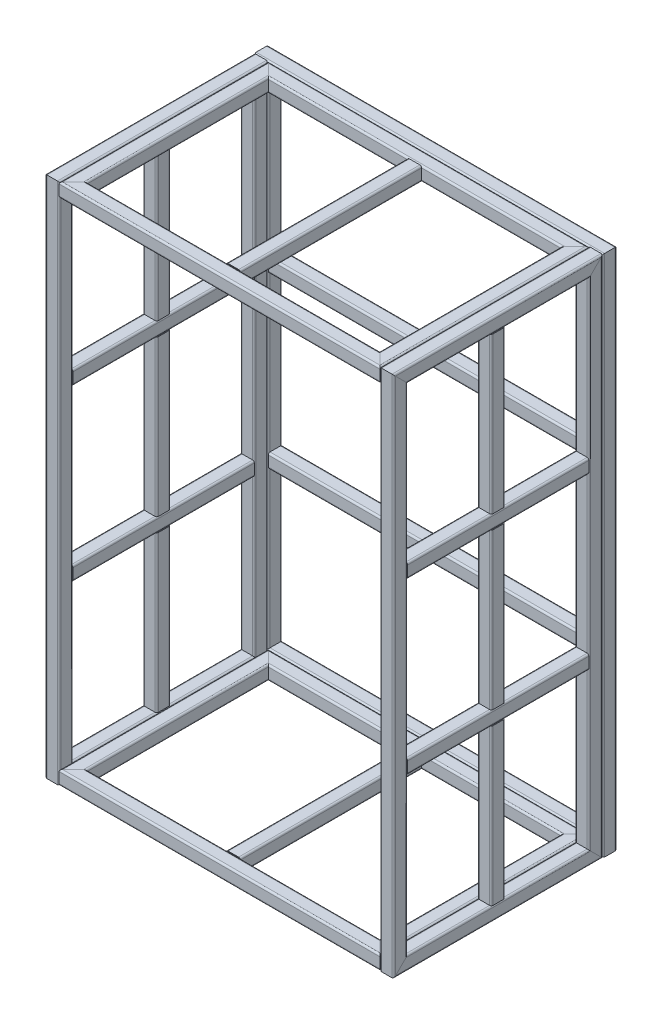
from build123d import *

# Parameters (mm, degrees)
PROFILE_POD_OGI_DEPTH              = 1977.568542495
PROFILE_POD_OGI_DEPTH_BACK         = 57.568542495
PROFILE_POD_OGI_2_DEPTH            = 3035.13708499
PROFILE_POD_OGI_3_DEPTH            = 2035.13708499
PROFILE_POD_OGI_4_DEPTH            = 3035.13708499
PROFILE_POD_OGI_5_DEPTH            = 1922
PROFILE_POD_OGI_6_DEPTH            = 1922
PROFILE_CIANY_BOCZNEJ_DEPTH        = 2977.568542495
PROFILE_CIANY_BOCZNEJ_DEPTH_BACK   = 57.568542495
PROFILE_CIANY_BOCZNEJ_2_DEPTH      = 1235.13708499
PROFILE_CIANY_BOCZNEJ_3_DEPTH      = 3035.13708499
PROFILE_CIANY_BOCZNEJ_4_DEPTH      = 1235.13708499
PROFILE_CIANY_BOCZNEJ_5_DEPTH      = 1122
PROFILE_CIANY_BOCZNEJ_6_DEPTH      = 1122
PROFILE_CIANY_BOCZNEJ_7_DEPTH      = 975.333333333
PROFILE_CIANY_BOCZNEJ_8_DEPTH      = 975.333333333
PROFILE_CIANY_BOCZNEJ_9_DEPTH      = 975.333333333
PROFILE_CIANY_PRZEDNIEJ_DEPTH      = 1177.568542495
PROFILE_CIANY_PRZEDNIEJ_DEPTH_BACK = 57.568542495
PROFILE_CIANY_PRZEDNIEJ_2_DEPTH    = 1875.13708499
PROFILE_CIANY_PRZEDNIEJ_3_DEPTH    = 1235.13708499
PROFILE_CIANY_PRZEDNIEJ_4_DEPTH    = 1875.13708499
PROFILE_CIANY_PRZEDNIEJ_5_DEPTH    = 1122


with BuildPart() as part:
    # Sketch15 → Profile pod_ogi (new, two sides: drawn at the far end of the back side and taken through both)
    with BuildSketch(Plane(origin=(960, -1460, 0), x_dir=(0, -1, 0), z_dir=(-1, 0, 0)).offset(-PROFILE_POD_OGI_DEPTH_BACK)):
        with BuildLine():
            Line((-30, -40), (30, -40))
            ThreePointArc((30, -40), (37.071067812, -37.071067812), (40, -30))
            Line((40, -30), (40, 30))
            ThreePointArc((40, 30), (37.071067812, 37.071067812), (30, 40))
            Line((30, 40), (-30, 40))
            ThreePointArc((-30, 40), (-37.071067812, 37.071067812), (-40, 30))
            Line((-40, 30), (-40, -30))
            ThreePointArc((-40, -30), (-37.071067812, -37.071067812), (-30, -40))
        make_face()
        with BuildLine():
            Line((-30, -35), (30, -35))
            ThreePointArc((30, -35), (33.535533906, -33.535533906), (35, -30))
            Line((35, -30), (35, 30))
            ThreePointArc((35, 30), (33.535533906, 33.535533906), (30, 35))
            Line((30, 35), (-30, 35))
            ThreePointArc((-30, 35), (-33.535533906, 33.535533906), (-35, 30))
            Line((-35, 30), (-35, -30))
            ThreePointArc((-35, -30), (-33.535533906, -33.535533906), (-30, -35))
        make_face(mode=Mode.SUBTRACT)
    extrude(amount=PROFILE_POD_OGI_DEPTH + PROFILE_POD_OGI_DEPTH_BACK)

    # Profile pod_ogi mitre 1
    split(bisect_by=Plane(origin=(960, -1460, 0), x_dir=(0.707106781, -0.707106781, 0), z_dir=(-0.707106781, -0.707106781, 0)), keep=Keep.TOP)

    # Profile pod_ogi mitre 2
    split(bisect_by=Plane(origin=(-960, -1460, 0), x_dir=(0.707106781, 0.707106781, 0), z_dir=(0.707106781, -0.707106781, 0)), keep=Keep.TOP)


with BuildPart() as body_2:
    # Sketch15 on segment 2 (on carried to segment 2) → Profile pod_ogi 2 (new body)
    with BuildSketch(Plane(origin=(-960, -1517.568542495, 0), x_dir=(-1, 0, 0), z_dir=(0, 1, 0))):
        with BuildLine():
            Line((-30, -40), (30, -40))
            ThreePointArc((30, -40), (37.071067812, -37.071067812), (40, -30))
            Line((40, -30), (40, 30))
            ThreePointArc((40, 30), (37.071067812, 37.071067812), (30, 40))
            Line((30, 40), (-30, 40))
            ThreePointArc((-30, 40), (-37.071067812, 37.071067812), (-40, 30))
            Line((-40, 30), (-40, -30))
            ThreePointArc((-40, -30), (-37.071067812, -37.071067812), (-30, -40))
        make_face()
        with BuildLine():
            Line((-30, -35), (30, -35))
            ThreePointArc((30, -35), (33.535533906, -33.535533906), (35, -30))
            Line((35, -30), (35, 30))
            ThreePointArc((35, 30), (33.535533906, 33.535533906), (30, 35))
            Line((30, 35), (-30, 35))
            ThreePointArc((-30, 35), (-33.535533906, 33.535533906), (-35, 30))
            Line((-35, 30), (-35, -30))
            ThreePointArc((-35, -30), (-33.535533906, -33.535533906), (-30, -35))
        make_face(mode=Mode.SUBTRACT)
    extrude(amount=PROFILE_POD_OGI_2_DEPTH)

    # Profile pod_ogi 2 mitre 1
    split(bisect_by=Plane(origin=(-960, -1460, 0), x_dir=(-0.707106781, -0.707106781, 0), z_dir=(-0.707106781, 0.707106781, 0)), keep=Keep.TOP)

    # Profile pod_ogi 2 mitre 2
    split(bisect_by=Plane(origin=(-960, 1460, 0), x_dir=(0.707106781, -0.707106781, 0), z_dir=(-0.707106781, -0.707106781, 0)), keep=Keep.TOP)


with BuildPart() as body_3:
    # Sketch15 on segment 3 (on carried to segment 3) → Profile pod_ogi 3 (new body)
    with BuildSketch(Plane(origin=(-1017.568542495, 1460, 0), x_dir=(0, 1, 0), z_dir=(1, 0, 0))):
        with BuildLine():
            Line((-30, -40), (30, -40))
            ThreePointArc((30, -40), (37.071067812, -37.071067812), (40, -30))
            Line((40, -30), (40, 30))
            ThreePointArc((40, 30), (37.071067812, 37.071067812), (30, 40))
            Line((30, 40), (-30, 40))
            ThreePointArc((-30, 40), (-37.071067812, 37.071067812), (-40, 30))
            Line((-40, 30), (-40, -30))
            ThreePointArc((-40, -30), (-37.071067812, -37.071067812), (-30, -40))
        make_face()
        with BuildLine():
            Line((-30, -35), (30, -35))
            ThreePointArc((30, -35), (33.535533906, -33.535533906), (35, -30))
            Line((35, -30), (35, 30))
            ThreePointArc((35, 30), (33.535533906, 33.535533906), (30, 35))
            Line((30, 35), (-30, 35))
            ThreePointArc((-30, 35), (-33.535533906, 33.535533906), (-35, 30))
            Line((-35, 30), (-35, -30))
            ThreePointArc((-35, -30), (-33.535533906, -33.535533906), (-30, -35))
        make_face(mode=Mode.SUBTRACT)
    extrude(amount=PROFILE_POD_OGI_3_DEPTH)

    # Profile pod_ogi 3 mitre 1
    split(bisect_by=Plane(origin=(960, 1460, 0), x_dir=(-0.707106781, -0.707106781, 0), z_dir=(-0.707106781, 0.707106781, 0)), keep=Keep.TOP)

    # Profile pod_ogi 3 mitre 2
    split(bisect_by=Plane(origin=(-960, 1460, 0), x_dir=(-0.707106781, 0.707106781, 0), z_dir=(0.707106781, 0.707106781, 0)), keep=Keep.TOP)


with BuildPart() as body_4:
    # Sketch15 on segment 4 (on carried to segment 4) → Profile pod_ogi 4 (new body)
    with BuildSketch(Plane(origin=(960, 1517.568542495, 0), x_dir=(1, 0, 0), z_dir=(0, -1, 0))):
        with BuildLine():
            Line((-30, -40), (30, -40))
            ThreePointArc((30, -40), (37.071067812, -37.071067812), (40, -30))
            Line((40, -30), (40, 30))
            ThreePointArc((40, 30), (37.071067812, 37.071067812), (30, 40))
            Line((30, 40), (-30, 40))
            ThreePointArc((-30, 40), (-37.071067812, 37.071067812), (-40, 30))
            Line((-40, 30), (-40, -30))
            ThreePointArc((-40, -30), (-37.071067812, -37.071067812), (-30, -40))
        make_face()
        with BuildLine():
            Line((-30, -35), (30, -35))
            ThreePointArc((30, -35), (33.535533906, -33.535533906), (35, -30))
            Line((35, -30), (35, 30))
            ThreePointArc((35, 30), (33.535533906, 33.535533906), (30, 35))
            Line((30, 35), (-30, 35))
            ThreePointArc((-30, 35), (-33.535533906, 33.535533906), (-35, 30))
            Line((-35, 30), (-35, -30))
            ThreePointArc((-35, -30), (-33.535533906, -33.535533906), (-30, -35))
        make_face(mode=Mode.SUBTRACT)
    extrude(amount=PROFILE_POD_OGI_4_DEPTH)

    # Profile pod_ogi 4 mitre 1
    split(bisect_by=Plane(origin=(960, -1460, 0), x_dir=(-0.707106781, 0.707106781, 0), z_dir=(0.707106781, 0.707106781, 0)), keep=Keep.TOP)

    # Profile pod_ogi 4 mitre 2
    split(bisect_by=Plane(origin=(960, 1460, 0), x_dir=(0.707106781, 0.707106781, 0), z_dir=(0.707106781, -0.707106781, 0)), keep=Keep.TOP)


with BuildPart() as body_5:
    # Sketch15 on segment 5 (on carried to segment 5) → Profile pod_ogi 5 (new body)
    with BuildSketch(Plane(origin=(-961, -486.666666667, 0), x_dir=(0, 1, 0), z_dir=(1, 0, 0))):
        with BuildLine():
            Line((-30, -40), (30, -40))
            ThreePointArc((30, -40), (37.071067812, -37.071067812), (40, -30))
            Line((40, -30), (40, 30))
            ThreePointArc((40, 30), (37.071067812, 37.071067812), (30, 40))
            Line((30, 40), (-30, 40))
            ThreePointArc((-30, 40), (-37.071067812, 37.071067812), (-40, 30))
            Line((-40, 30), (-40, -30))
            ThreePointArc((-40, -30), (-37.071067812, -37.071067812), (-30, -40))
        make_face()
        with BuildLine():
            Line((-30, -35), (30, -35))
            ThreePointArc((30, -35), (33.535533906, -33.535533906), (35, -30))
            Line((35, -30), (35, 30))
            ThreePointArc((35, 30), (33.535533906, 33.535533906), (30, 35))
            Line((30, 35), (-30, 35))
            ThreePointArc((-30, 35), (-33.535533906, 33.535533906), (-35, 30))
            Line((-35, 30), (-35, -30))
            ThreePointArc((-35, -30), (-33.535533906, -33.535533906), (-30, -35))
        make_face(mode=Mode.SUBTRACT)
    extrude(amount=PROFILE_POD_OGI_5_DEPTH)

    # Profile pod_ogi 5 mitre 1
    split(bisect_by=Plane(origin=(-920, -486.666666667, 0), x_dir=(0, 1, 0), z_dir=(1, 0, 0)), keep=Keep.TOP)

    # Profile pod_ogi 5 mitre 2
    split(bisect_by=Plane(origin=(920, -486.666666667, 0), x_dir=(0, -1, 0), z_dir=(-1, 0, 0)), keep=Keep.TOP)


with BuildPart() as body_6:
    # Sketch15 on segment 6 (on carried to segment 6) → Profile pod_ogi 6 (new body)
    with BuildSketch(Plane(origin=(-961, 486.666666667, 0), x_dir=(0, 1, 0), z_dir=(1, 0, 0))):
        with BuildLine():
            Line((-30, -40), (30, -40))
            ThreePointArc((30, -40), (37.071067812, -37.071067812), (40, -30))
            Line((40, -30), (40, 30))
            ThreePointArc((40, 30), (37.071067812, 37.071067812), (30, 40))
            Line((30, 40), (-30, 40))
            ThreePointArc((-30, 40), (-37.071067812, 37.071067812), (-40, 30))
            Line((-40, 30), (-40, -30))
            ThreePointArc((-40, -30), (-37.071067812, -37.071067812), (-30, -40))
        make_face()
        with BuildLine():
            Line((-30, -35), (30, -35))
            ThreePointArc((30, -35), (33.535533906, -33.535533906), (35, -30))
            Line((35, -30), (35, 30))
            ThreePointArc((35, 30), (33.535533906, 33.535533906), (30, 35))
            Line((30, 35), (-30, 35))
            ThreePointArc((-30, 35), (-33.535533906, 33.535533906), (-35, 30))
            Line((-35, 30), (-35, -30))
            ThreePointArc((-35, -30), (-33.535533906, -33.535533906), (-30, -35))
        make_face(mode=Mode.SUBTRACT)
    extrude(amount=PROFILE_POD_OGI_6_DEPTH)

    # Profile pod_ogi 6 mitre 1
    split(bisect_by=Plane(origin=(-920, 486.666666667, 0), x_dir=(0, 1, 0), z_dir=(1, 0, 0)), keep=Keep.TOP)

    # Profile pod_ogi 6 mitre 2
    split(bisect_by=Plane(origin=(920, 486.666666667, 0), x_dir=(0, -1, 0), z_dir=(-1, 0, 0)), keep=Keep.TOP)


with BuildPart() as body_7:
    # Sketch16 → Profile _ciany bocznej (new, two sides: drawn at the far end of the back side and taken through both)
    with BuildSketch(Plane(origin=(-960, -1460, 80), x_dir=(0, 0, 1), z_dir=(0, 1, 0)).offset(-PROFILE_CIANY_BOCZNEJ_DEPTH_BACK)):
        with BuildLine():
            Line((-30, -40), (30, -40))
            ThreePointArc((30, -40), (37.071067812, -37.071067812), (40, -30))
            Line((40, -30), (40, 30))
            ThreePointArc((40, 30), (37.071067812, 37.071067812), (30, 40))
            Line((30, 40), (-30, 40))
            ThreePointArc((-30, 40), (-37.071067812, 37.071067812), (-40, 30))
            Line((-40, 30), (-40, -30))
            ThreePointArc((-40, -30), (-37.071067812, -37.071067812), (-30, -40))
        make_face()
        with BuildLine():
            Line((-30, -35), (30, -35))
            ThreePointArc((30, -35), (33.535533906, -33.535533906), (35, -30))
            Line((35, -30), (35, 30))
            ThreePointArc((35, 30), (33.535533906, 33.535533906), (30, 35))
            Line((30, 35), (-30, 35))
            ThreePointArc((-30, 35), (-33.535533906, 33.535533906), (-35, 30))
            Line((-35, 30), (-35, -30))
            ThreePointArc((-35, -30), (-33.535533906, -33.535533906), (-30, -35))
        make_face(mode=Mode.SUBTRACT)
    extrude(amount=PROFILE_CIANY_BOCZNEJ_DEPTH + PROFILE_CIANY_BOCZNEJ_DEPTH_BACK)

    # Profile _ciany bocznej mitre 1
    split(bisect_by=Plane(origin=(-960, -1460, 80), x_dir=(-1, 0, 0), z_dir=(0, 0.707106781, -0.707106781)), keep=Keep.TOP)

    # Profile _ciany bocznej mitre 2
    split(bisect_by=Plane(origin=(-960, 1460, 80), x_dir=(1, 0, 0), z_dir=(0, -0.707106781, -0.707106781)), keep=Keep.TOP)


with BuildPart() as body_8:
    # Sketch16 on segment 2 (on carried to segment 2) → Profile _ciany bocznej 2 (new body)
    with BuildSketch(Plane(origin=(-960, 1460, 22.431457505), x_dir=(0, -1, 0), z_dir=(0, 0, 1))):
        with BuildLine():
            Line((-30, -40), (30, -40))
            ThreePointArc((30, -40), (37.071067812, -37.071067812), (40, -30))
            Line((40, -30), (40, 30))
            ThreePointArc((40, 30), (37.071067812, 37.071067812), (30, 40))
            Line((30, 40), (-30, 40))
            ThreePointArc((-30, 40), (-37.071067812, 37.071067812), (-40, 30))
            Line((-40, 30), (-40, -30))
            ThreePointArc((-40, -30), (-37.071067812, -37.071067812), (-30, -40))
        make_face()
        with BuildLine():
            Line((-30, -35), (30, -35))
            ThreePointArc((30, -35), (33.535533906, -33.535533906), (35, -30))
            Line((35, -30), (35, 30))
            ThreePointArc((35, 30), (33.535533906, 33.535533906), (30, 35))
            Line((30, 35), (-30, 35))
            ThreePointArc((-30, 35), (-33.535533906, 33.535533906), (-35, 30))
            Line((-35, 30), (-35, -30))
            ThreePointArc((-35, -30), (-33.535533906, -33.535533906), (-30, -35))
        make_face(mode=Mode.SUBTRACT)
    extrude(amount=PROFILE_CIANY_BOCZNEJ_2_DEPTH)

    # Profile _ciany bocznej 2 mitre 1
    split(bisect_by=Plane(origin=(-960, 1460, 80), x_dir=(-1, 0, 0), z_dir=(0, 0.707106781, 0.707106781)), keep=Keep.TOP)

    # Profile _ciany bocznej 2 mitre 2
    split(bisect_by=Plane(origin=(-960, 1460, 1200), x_dir=(-1, 0, 0), z_dir=(0, 0.707106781, -0.707106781)), keep=Keep.TOP)


with BuildPart() as body_9:
    # Sketch16 on segment 3 (on carried to segment 3) → Profile _ciany bocznej 3 (new body)
    with BuildSketch(Plane(origin=(-960, 1517.568542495, 1200), x_dir=(0, 0, -1), z_dir=(0, -1, 0))):
        with BuildLine():
            Line((-30, -40), (30, -40))
            ThreePointArc((30, -40), (37.071067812, -37.071067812), (40, -30))
            Line((40, -30), (40, 30))
            ThreePointArc((40, 30), (37.071067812, 37.071067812), (30, 40))
            Line((30, 40), (-30, 40))
            ThreePointArc((-30, 40), (-37.071067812, 37.071067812), (-40, 30))
            Line((-40, 30), (-40, -30))
            ThreePointArc((-40, -30), (-37.071067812, -37.071067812), (-30, -40))
        make_face()
        with BuildLine():
            Line((-30, -35), (30, -35))
            ThreePointArc((30, -35), (33.535533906, -33.535533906), (35, -30))
            Line((35, -30), (35, 30))
            ThreePointArc((35, 30), (33.535533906, 33.535533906), (30, 35))
            Line((30, 35), (-30, 35))
            ThreePointArc((-30, 35), (-33.535533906, 33.535533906), (-35, 30))
            Line((-35, 30), (-35, -30))
            ThreePointArc((-35, -30), (-33.535533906, -33.535533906), (-30, -35))
        make_face(mode=Mode.SUBTRACT)
    extrude(amount=PROFILE_CIANY_BOCZNEJ_3_DEPTH)

    # Profile _ciany bocznej 3 mitre 1
    split(bisect_by=Plane(origin=(-960, -1460, 1200), x_dir=(-1, 0, 0), z_dir=(0, 0.707106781, 0.707106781)), keep=Keep.TOP)

    # Profile _ciany bocznej 3 mitre 2
    split(bisect_by=Plane(origin=(-960, 1460, 1200), x_dir=(1, 0, 0), z_dir=(0, -0.707106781, 0.707106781)), keep=Keep.TOP)


with BuildPart() as body_10:
    # Sketch16 on segment 4 (on carried to segment 4) → Profile _ciany bocznej 4 (new body)
    with BuildSketch(Plane(origin=(-960, -1460, 1257.568542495), x_dir=(0, 1, 0), z_dir=(0, 0, -1))):
        with BuildLine():
            Line((-30, -40), (30, -40))
            ThreePointArc((30, -40), (37.071067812, -37.071067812), (40, -30))
            Line((40, -30), (40, 30))
            ThreePointArc((40, 30), (37.071067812, 37.071067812), (30, 40))
            Line((30, 40), (-30, 40))
            ThreePointArc((-30, 40), (-37.071067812, 37.071067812), (-40, 30))
            Line((-40, 30), (-40, -30))
            ThreePointArc((-40, -30), (-37.071067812, -37.071067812), (-30, -40))
        make_face()
        with BuildLine():
            Line((-30, -35), (30, -35))
            ThreePointArc((30, -35), (33.535533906, -33.535533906), (35, -30))
            Line((35, -30), (35, 30))
            ThreePointArc((35, 30), (33.535533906, 33.535533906), (30, 35))
            Line((30, 35), (-30, 35))
            ThreePointArc((-30, 35), (-33.535533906, 33.535533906), (-35, 30))
            Line((-35, 30), (-35, -30))
            ThreePointArc((-35, -30), (-33.535533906, -33.535533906), (-30, -35))
        make_face(mode=Mode.SUBTRACT)
    extrude(amount=PROFILE_CIANY_BOCZNEJ_4_DEPTH)

    # Profile _ciany bocznej 4 mitre 1
    split(bisect_by=Plane(origin=(-960, -1460, 80), x_dir=(1, 0, 0), z_dir=(0, -0.707106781, 0.707106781)), keep=Keep.TOP)

    # Profile _ciany bocznej 4 mitre 2
    split(bisect_by=Plane(origin=(-960, -1460, 1200), x_dir=(1, 0, 0), z_dir=(0, -0.707106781, -0.707106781)), keep=Keep.TOP)


with BuildPart() as body_11:
    # Sketch16 on segment 5 (on carried to segment 5) → Profile _ciany bocznej 5 (new body)
    with BuildSketch(Plane(origin=(-960, -486.666666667, 1201), x_dir=(0, 1, 0), z_dir=(0, 0, -1))):
        with BuildLine():
            Line((-30, -40), (30, -40))
            ThreePointArc((30, -40), (37.071067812, -37.071067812), (40, -30))
            Line((40, -30), (40, 30))
            ThreePointArc((40, 30), (37.071067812, 37.071067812), (30, 40))
            Line((30, 40), (-30, 40))
            ThreePointArc((-30, 40), (-37.071067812, 37.071067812), (-40, 30))
            Line((-40, 30), (-40, -30))
            ThreePointArc((-40, -30), (-37.071067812, -37.071067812), (-30, -40))
        make_face()
        with BuildLine():
            Line((-30, -35), (30, -35))
            ThreePointArc((30, -35), (33.535533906, -33.535533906), (35, -30))
            Line((35, -30), (35, 30))
            ThreePointArc((35, 30), (33.535533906, 33.535533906), (30, 35))
            Line((30, 35), (-30, 35))
            ThreePointArc((-30, 35), (-33.535533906, 33.535533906), (-35, 30))
            Line((-35, 30), (-35, -30))
            ThreePointArc((-35, -30), (-33.535533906, -33.535533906), (-30, -35))
        make_face(mode=Mode.SUBTRACT)
    extrude(amount=PROFILE_CIANY_BOCZNEJ_5_DEPTH)

    # Profile _ciany bocznej 5 mitre 1
    split(bisect_by=Plane(origin=(-960, -486.666666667, 1160), x_dir=(0, 1, 0), z_dir=(0, 0, -1)), keep=Keep.TOP)

    # Profile _ciany bocznej 5 mitre 2
    split(bisect_by=Plane(origin=(-960, -486.666666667, 120), x_dir=(0, -1, 0), z_dir=(0, 0, 1)), keep=Keep.TOP)


with BuildPart() as body_12:
    # Sketch16 on segment 6 (on carried to segment 6) → Profile _ciany bocznej 6 (new body)
    with BuildSketch(Plane(origin=(-960, 486.666666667, 1201), x_dir=(0, 1, 0), z_dir=(0, 0, -1))):
        with BuildLine():
            Line((-30, -40), (30, -40))
            ThreePointArc((30, -40), (37.071067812, -37.071067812), (40, -30))
            Line((40, -30), (40, 30))
            ThreePointArc((40, 30), (37.071067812, 37.071067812), (30, 40))
            Line((30, 40), (-30, 40))
            ThreePointArc((-30, 40), (-37.071067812, 37.071067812), (-40, 30))
            Line((-40, 30), (-40, -30))
            ThreePointArc((-40, -30), (-37.071067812, -37.071067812), (-30, -40))
        make_face()
        with BuildLine():
            Line((-30, -35), (30, -35))
            ThreePointArc((30, -35), (33.535533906, -33.535533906), (35, -30))
            Line((35, -30), (35, 30))
            ThreePointArc((35, 30), (33.535533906, 33.535533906), (30, 35))
            Line((30, 35), (-30, 35))
            ThreePointArc((-30, 35), (-33.535533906, 33.535533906), (-35, 30))
            Line((-35, 30), (-35, -30))
            ThreePointArc((-35, -30), (-33.535533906, -33.535533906), (-30, -35))
        make_face(mode=Mode.SUBTRACT)
    extrude(amount=PROFILE_CIANY_BOCZNEJ_6_DEPTH)

    # Profile _ciany bocznej 6 mitre 1
    split(bisect_by=Plane(origin=(-960, 486.666666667, 1160), x_dir=(0, 1, 0), z_dir=(0, 0, -1)), keep=Keep.TOP)

    # Profile _ciany bocznej 6 mitre 2
    split(bisect_by=Plane(origin=(-960, 486.666666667, 120), x_dir=(0, -1, 0), z_dir=(0, 0, 1)), keep=Keep.TOP)


with BuildPart() as body_13:
    # Sketch16 on segment 7 (on carried to segment 7) → Profile _ciany bocznej 7 (new body)
    with BuildSketch(Plane(origin=(-960, -1461, 640), x_dir=(0, 0, 1), z_dir=(0, 1, 0))):
        with BuildLine():
            Line((-30, -40), (30, -40))
            ThreePointArc((30, -40), (37.071067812, -37.071067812), (40, -30))
            Line((40, -30), (40, 30))
            ThreePointArc((40, 30), (37.071067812, 37.071067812), (30, 40))
            Line((30, 40), (-30, 40))
            ThreePointArc((-30, 40), (-37.071067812, 37.071067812), (-40, 30))
            Line((-40, 30), (-40, -30))
            ThreePointArc((-40, -30), (-37.071067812, -37.071067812), (-30, -40))
        make_face()
        with BuildLine():
            Line((-30, -35), (30, -35))
            ThreePointArc((30, -35), (33.535533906, -33.535533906), (35, -30))
            Line((35, -30), (35, 30))
            ThreePointArc((35, 30), (33.535533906, 33.535533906), (30, 35))
            Line((30, 35), (-30, 35))
            ThreePointArc((-30, 35), (-33.535533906, 33.535533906), (-35, 30))
            Line((-35, 30), (-35, -30))
            ThreePointArc((-35, -30), (-33.535533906, -33.535533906), (-30, -35))
        make_face(mode=Mode.SUBTRACT)
    extrude(amount=PROFILE_CIANY_BOCZNEJ_7_DEPTH)

    # Profile _ciany bocznej 7 mitre 1
    split(bisect_by=Plane(origin=(-960, -486.666666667, 640), x_dir=(1, 0, 0), z_dir=(0, -1, 0)), keep=Keep.TOP)

    # Profile _ciany bocznej 7 mitre 2
    split(bisect_by=Plane(origin=(-960, -1420, 640), x_dir=(-1, 0, 0), z_dir=(0, 1, 0)), keep=Keep.TOP)

    # Profile _ciany bocznej 7 mitre 3
    split(bisect_by=Plane(origin=(-960, -526.666666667, 640), x_dir=(1, 0, 0), z_dir=(0, -1, 0)), keep=Keep.TOP)


with BuildPart() as body_14:
    # Sketch16 on segment 8 (on carried to segment 8) → Profile _ciany bocznej 8 (new body)
    with BuildSketch(Plane(origin=(-960, -487.666666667, 640), x_dir=(0, 0, 1), z_dir=(0, 1, 0))):
        with BuildLine():
            Line((-30, -40), (30, -40))
            ThreePointArc((30, -40), (37.071067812, -37.071067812), (40, -30))
            Line((40, -30), (40, 30))
            ThreePointArc((40, 30), (37.071067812, 37.071067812), (30, 40))
            Line((30, 40), (-30, 40))
            ThreePointArc((-30, 40), (-37.071067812, 37.071067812), (-40, 30))
            Line((-40, 30), (-40, -30))
            ThreePointArc((-40, -30), (-37.071067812, -37.071067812), (-30, -40))
        make_face()
        with BuildLine():
            Line((-30, -35), (30, -35))
            ThreePointArc((30, -35), (33.535533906, -33.535533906), (35, -30))
            Line((35, -30), (35, 30))
            ThreePointArc((35, 30), (33.535533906, 33.535533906), (30, 35))
            Line((30, 35), (-30, 35))
            ThreePointArc((-30, 35), (-33.535533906, 33.535533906), (-35, 30))
            Line((-35, 30), (-35, -30))
            ThreePointArc((-35, -30), (-33.535533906, -33.535533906), (-30, -35))
        make_face(mode=Mode.SUBTRACT)
    extrude(amount=PROFILE_CIANY_BOCZNEJ_8_DEPTH)

    # Profile _ciany bocznej 8 mitre 1
    split(bisect_by=Plane(origin=(-960, -486.666666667, 640), x_dir=(-1, 0, 0), z_dir=(0, 1, 0)), keep=Keep.TOP)

    # Profile _ciany bocznej 8 mitre 2
    split(bisect_by=Plane(origin=(-960, 486.666666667, 640), x_dir=(1, 0, 0), z_dir=(0, -1, 0)), keep=Keep.TOP)

    # Profile _ciany bocznej 8 mitre 3
    split(bisect_by=Plane(origin=(-960, -446.666666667, 640), x_dir=(-1, 0, 0), z_dir=(0, 1, 0)), keep=Keep.TOP)

    # Profile _ciany bocznej 8 mitre 4
    split(bisect_by=Plane(origin=(-960, 446.666666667, 640), x_dir=(1, 0, 0), z_dir=(0, -1, 0)), keep=Keep.TOP)


with BuildPart() as body_15:
    # Sketch16 on segment 9 (on carried to segment 9) → Profile _ciany bocznej 9 (new body)
    with BuildSketch(Plane(origin=(-960, 485.666666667, 640), x_dir=(0, 0, 1), z_dir=(0, 1, 0))):
        with BuildLine():
            Line((-30, -40), (30, -40))
            ThreePointArc((30, -40), (37.071067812, -37.071067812), (40, -30))
            Line((40, -30), (40, 30))
            ThreePointArc((40, 30), (37.071067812, 37.071067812), (30, 40))
            Line((30, 40), (-30, 40))
            ThreePointArc((-30, 40), (-37.071067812, 37.071067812), (-40, 30))
            Line((-40, 30), (-40, -30))
            ThreePointArc((-40, -30), (-37.071067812, -37.071067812), (-30, -40))
        make_face()
        with BuildLine():
            Line((-30, -35), (30, -35))
            ThreePointArc((30, -35), (33.535533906, -33.535533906), (35, -30))
            Line((35, -30), (35, 30))
            ThreePointArc((35, 30), (33.535533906, 33.535533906), (30, 35))
            Line((30, 35), (-30, 35))
            ThreePointArc((-30, 35), (-33.535533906, 33.535533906), (-35, 30))
            Line((-35, 30), (-35, -30))
            ThreePointArc((-35, -30), (-33.535533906, -33.535533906), (-30, -35))
        make_face(mode=Mode.SUBTRACT)
    extrude(amount=PROFILE_CIANY_BOCZNEJ_9_DEPTH)

    # Profile _ciany bocznej 9 mitre 1
    split(bisect_by=Plane(origin=(-960, 486.666666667, 640), x_dir=(-1, 0, 0), z_dir=(0, 1, 0)), keep=Keep.TOP)

    # Profile _ciany bocznej 9 mitre 2
    split(bisect_by=Plane(origin=(-960, 526.666666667, 640), x_dir=(-1, 0, 0), z_dir=(0, 1, 0)), keep=Keep.TOP)

    # Profile _ciany bocznej 9 mitre 3
    split(bisect_by=Plane(origin=(-960, 1420, 640), x_dir=(1, 0, 0), z_dir=(0, -1, 0)), keep=Keep.TOP)


with BuildPart() as body_16:
    # Sketch1 → Profile _ciany przedniej (new, two sides: drawn at the far end of the back side and taken through both)
    with BuildSketch(Plane(origin=(-880, -1460, 1200), x_dir=(-1, 0, 0), z_dir=(0, 0, -1)).offset(-PROFILE_CIANY_PRZEDNIEJ_DEPTH_BACK)):
        with BuildLine():
            Line((-30, -40), (30, -40))
            ThreePointArc((30, -40), (37.071067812, -37.071067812), (40, -30))
            Line((40, -30), (40, 30))
            ThreePointArc((40, 30), (37.071067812, 37.071067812), (30, 40))
            Line((30, 40), (-30, 40))
            ThreePointArc((-30, 40), (-37.071067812, 37.071067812), (-40, 30))
            Line((-40, 30), (-40, -30))
            ThreePointArc((-40, -30), (-37.071067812, -37.071067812), (-30, -40))
        make_face()
        with BuildLine():
            Line((-30, -35), (30, -35))
            ThreePointArc((30, -35), (33.535533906, -33.535533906), (35, -30))
            Line((35, -30), (35, 30))
            ThreePointArc((35, 30), (33.535533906, 33.535533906), (30, 35))
            Line((30, 35), (-30, 35))
            ThreePointArc((-30, 35), (-33.535533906, 33.535533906), (-35, 30))
            Line((-35, 30), (-35, -30))
            ThreePointArc((-35, -30), (-33.535533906, -33.535533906), (-30, -35))
        make_face(mode=Mode.SUBTRACT)
    extrude(amount=PROFILE_CIANY_PRZEDNIEJ_DEPTH + PROFILE_CIANY_PRZEDNIEJ_DEPTH_BACK)

    # Profile _ciany przedniej mitre 1
    split(bisect_by=Plane(origin=(-880, -1460, 1200), x_dir=(0, -1, 0), z_dir=(-0.707106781, 0, -0.707106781)), keep=Keep.TOP)

    # Profile _ciany przedniej mitre 2
    split(bisect_by=Plane(origin=(-880, -1460, 80), x_dir=(0, -1, 0), z_dir=(-0.707106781, 0, 0.707106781)), keep=Keep.TOP)


with BuildPart() as body_17:
    # Sketch1 on segment 2 (on carried to segment 2) → Profile _ciany przedniej 2 (new body)
    with BuildSketch(Plane(origin=(-937.568542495, -1460, 80), x_dir=(0, 0, -1), z_dir=(1, 0, 0))):
        with BuildLine():
            Line((-30, -40), (30, -40))
            ThreePointArc((30, -40), (37.071067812, -37.071067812), (40, -30))
            Line((40, -30), (40, 30))
            ThreePointArc((40, 30), (37.071067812, 37.071067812), (30, 40))
            Line((30, 40), (-30, 40))
            ThreePointArc((-30, 40), (-37.071067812, 37.071067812), (-40, 30))
            Line((-40, 30), (-40, -30))
            ThreePointArc((-40, -30), (-37.071067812, -37.071067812), (-30, -40))
        make_face()
        with BuildLine():
            Line((-30, -35), (30, -35))
            ThreePointArc((30, -35), (33.535533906, -33.535533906), (35, -30))
            Line((35, -30), (35, 30))
            ThreePointArc((35, 30), (33.535533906, 33.535533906), (30, 35))
            Line((30, 35), (-30, 35))
            ThreePointArc((-30, 35), (-33.535533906, 33.535533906), (-35, 30))
            Line((-35, 30), (-35, -30))
            ThreePointArc((-35, -30), (-33.535533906, -33.535533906), (-30, -35))
        make_face(mode=Mode.SUBTRACT)
    extrude(amount=PROFILE_CIANY_PRZEDNIEJ_2_DEPTH)

    # Profile _ciany przedniej 2 mitre 1
    split(bisect_by=Plane(origin=(-880, -1460, 80), x_dir=(0, 1, 0), z_dir=(0.707106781, 0, -0.707106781)), keep=Keep.TOP)

    # Profile _ciany przedniej 2 mitre 2
    split(bisect_by=Plane(origin=(880, -1460, 80), x_dir=(0, -1, 0), z_dir=(-0.707106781, 0, -0.707106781)), keep=Keep.TOP)


with BuildPart() as body_18:
    # Sketch1 on segment 3 (on carried to segment 3) → Profile _ciany przedniej 3 (new body)
    with BuildSketch(Plane(origin=(880, -1460, 22.431457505), x_dir=(1, 0, 0), z_dir=(0, 0, 1))):
        with BuildLine():
            Line((-30, -40), (30, -40))
            ThreePointArc((30, -40), (37.071067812, -37.071067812), (40, -30))
            Line((40, -30), (40, 30))
            ThreePointArc((40, 30), (37.071067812, 37.071067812), (30, 40))
            Line((30, 40), (-30, 40))
            ThreePointArc((-30, 40), (-37.071067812, 37.071067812), (-40, 30))
            Line((-40, 30), (-40, -30))
            ThreePointArc((-40, -30), (-37.071067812, -37.071067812), (-30, -40))
        make_face()
        with BuildLine():
            Line((-30, -35), (30, -35))
            ThreePointArc((30, -35), (33.535533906, -33.535533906), (35, -30))
            Line((35, -30), (35, 30))
            ThreePointArc((35, 30), (33.535533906, 33.535533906), (30, 35))
            Line((30, 35), (-30, 35))
            ThreePointArc((-30, 35), (-33.535533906, 33.535533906), (-35, 30))
            Line((-35, 30), (-35, -30))
            ThreePointArc((-35, -30), (-33.535533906, -33.535533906), (-30, -35))
        make_face(mode=Mode.SUBTRACT)
    extrude(amount=PROFILE_CIANY_PRZEDNIEJ_3_DEPTH)

    # Profile _ciany przedniej 3 mitre 1
    split(bisect_by=Plane(origin=(880, -1460, 1200), x_dir=(0, 1, 0), z_dir=(0.707106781, 0, -0.707106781)), keep=Keep.TOP)

    # Profile _ciany przedniej 3 mitre 2
    split(bisect_by=Plane(origin=(880, -1460, 80), x_dir=(0, 1, 0), z_dir=(0.707106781, 0, 0.707106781)), keep=Keep.TOP)


with BuildPart() as body_19:
    # Sketch1 on segment 4 (on carried to segment 4) → Profile _ciany przedniej 4 (new body)
    with BuildSketch(Plane(origin=(937.568542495, -1460, 1200), x_dir=(0, 0, 1), z_dir=(-1, 0, 0))):
        with BuildLine():
            Line((-30, -40), (30, -40))
            ThreePointArc((30, -40), (37.071067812, -37.071067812), (40, -30))
            Line((40, -30), (40, 30))
            ThreePointArc((40, 30), (37.071067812, 37.071067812), (30, 40))
            Line((30, 40), (-30, 40))
            ThreePointArc((-30, 40), (-37.071067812, 37.071067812), (-40, 30))
            Line((-40, 30), (-40, -30))
            ThreePointArc((-40, -30), (-37.071067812, -37.071067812), (-30, -40))
        make_face()
        with BuildLine():
            Line((-30, -35), (30, -35))
            ThreePointArc((30, -35), (33.535533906, -33.535533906), (35, -30))
            Line((35, -30), (35, 30))
            ThreePointArc((35, 30), (33.535533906, 33.535533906), (30, 35))
            Line((30, 35), (-30, 35))
            ThreePointArc((-30, 35), (-33.535533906, 33.535533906), (-35, 30))
            Line((-35, 30), (-35, -30))
            ThreePointArc((-35, -30), (-33.535533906, -33.535533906), (-30, -35))
        make_face(mode=Mode.SUBTRACT)
    extrude(amount=PROFILE_CIANY_PRZEDNIEJ_4_DEPTH)

    # Profile _ciany przedniej 4 mitre 1
    split(bisect_by=Plane(origin=(-880, -1460, 1200), x_dir=(0, 1, 0), z_dir=(0.707106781, 0, 0.707106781)), keep=Keep.TOP)

    # Profile _ciany przedniej 4 mitre 2
    split(bisect_by=Plane(origin=(880, -1460, 1200), x_dir=(0, -1, 0), z_dir=(-0.707106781, 0, 0.707106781)), keep=Keep.TOP)


with BuildPart() as body_20:
    # Sketch1 on segment 5 (on carried to segment 5) → Profile _ciany przedniej 5 (new body)
    with BuildSketch(Plane(origin=(0, -1460, 1201), x_dir=(-1, 0, 0), z_dir=(0, 0, -1))):
        with BuildLine():
            Line((-30, -40), (30, -40))
            ThreePointArc((30, -40), (37.071067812, -37.071067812), (40, -30))
            Line((40, -30), (40, 30))
            ThreePointArc((40, 30), (37.071067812, 37.071067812), (30, 40))
            Line((30, 40), (-30, 40))
            ThreePointArc((-30, 40), (-37.071067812, 37.071067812), (-40, 30))
            Line((-40, 30), (-40, -30))
            ThreePointArc((-40, -30), (-37.071067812, -37.071067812), (-30, -40))
        make_face()
        with BuildLine():
            Line((-30, -35), (30, -35))
            ThreePointArc((30, -35), (33.535533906, -33.535533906), (35, -30))
            Line((35, -30), (35, 30))
            ThreePointArc((35, 30), (33.535533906, 33.535533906), (30, 35))
            Line((30, 35), (-30, 35))
            ThreePointArc((-30, 35), (-33.535533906, 33.535533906), (-35, 30))
            Line((-35, 30), (-35, -30))
            ThreePointArc((-35, -30), (-33.535533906, -33.535533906), (-30, -35))
        make_face(mode=Mode.SUBTRACT)
    extrude(amount=PROFILE_CIANY_PRZEDNIEJ_5_DEPTH)

    # Profile _ciany przedniej 5 mitre 1
    split(bisect_by=Plane(origin=(0, -1460, 1160), x_dir=(0, 1, 0), z_dir=(0, 0, -1)), keep=Keep.TOP)

    # Profile _ciany przedniej 5 mitre 2
    split(bisect_by=Plane(origin=(0, -1460, 120), x_dir=(0, -1, 0), z_dir=(0, 0, 1)), keep=Keep.TOP)


with BuildPart() as body_21:
    # Lustro1: mirrored copy
    add(body_10.part.mirror(Plane(origin=(0, 0, 0), x_dir=(0, 0, 1), z_dir=(1, 0, 0))))


with BuildPart() as body_22:
    # Lustro1 2: mirrored copy
    add(body_9.part.mirror(Plane(origin=(0, 0, 0), x_dir=(0, 0, 1), z_dir=(1, 0, 0))))


with BuildPart() as body_23:
    # Lustro1 3: mirrored copy
    add(body_8.part.mirror(Plane(origin=(0, 0, 0), x_dir=(0, 0, 1), z_dir=(1, 0, 0))))


with BuildPart() as body_24:
    # Lustro1 4: mirrored copy
    add(body_7.part.mirror(Plane(origin=(0, 0, 0), x_dir=(0, 0, 1), z_dir=(1, 0, 0))))


with BuildPart() as body_25:
    # Lustro1 5: mirrored copy
    add(body_12.part.mirror(Plane(origin=(0, 0, 0), x_dir=(0, 0, 1), z_dir=(1, 0, 0))))


with BuildPart() as body_26:
    # Lustro1 6: mirrored copy
    add(body_11.part.mirror(Plane(origin=(0, 0, 0), x_dir=(0, 0, 1), z_dir=(1, 0, 0))))


with BuildPart() as body_27:
    # Lustro1 7: mirrored copy
    add(body_13.part.mirror(Plane(origin=(0, 0, 0), x_dir=(0, 0, 1), z_dir=(1, 0, 0))))


with BuildPart() as body_28:
    # Lustro1 8: mirrored copy
    add(body_14.part.mirror(Plane(origin=(0, 0, 0), x_dir=(0, 0, 1), z_dir=(1, 0, 0))))


with BuildPart() as body_29:
    # Lustro1 9: mirrored copy
    add(body_15.part.mirror(Plane(origin=(0, 0, 0), x_dir=(0, 0, 1), z_dir=(1, 0, 0))))


with BuildPart() as body_30:
    # Lustro2: mirrored copy
    add(body_19.part.mirror(Plane.ZX))


with BuildPart() as body_31:
    # Lustro2 2: mirrored copy
    add(body_16.part.mirror(Plane.ZX))


with BuildPart() as body_32:
    # Lustro2 3: mirrored copy
    add(body_20.part.mirror(Plane.ZX))


with BuildPart() as body_33:
    # Lustro2 4: mirrored copy
    add(body_18.part.mirror(Plane.ZX))


with BuildPart() as body_34:
    # Lustro2 5: mirrored copy
    add(body_17.part.mirror(Plane.ZX))


solid = Compound([part.part, body_2.part, body_3.part, body_4.part, body_5.part, body_6.part, body_7.part, body_8.part, body_9.part, body_10.part, body_11.part, body_12.part, body_13.part, body_14.part, body_15.part, body_16.part, body_17.part, body_18.part, body_19.part, body_20.part, body_21.part, body_22.part, body_23.part, body_24.part, body_25.part, body_26.part, body_27.part, body_28.part, body_29.part, body_30.part, body_31.part, body_32.part, body_33.part, body_34.part])
